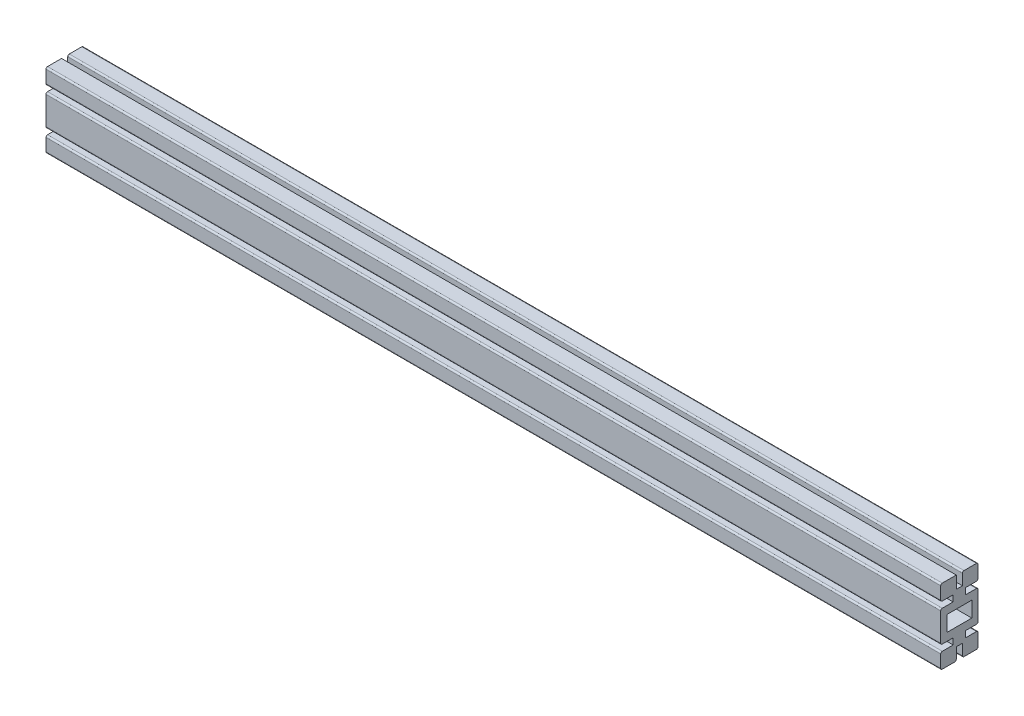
from build123d import *

# Parameters (mm, degrees)
SKETCH1_W           = 38.1
SKETCH1_H           = 76.2
BOSS_EXTRUDE1_DEPTH = 914.4
SKETCH2_W           = 12.7
SKETCH2_H           = 6.35
SKETCH2_W_2         = 6.35
SKETCH2_H_2         = 12.7
CUT_EXTRUDE1_DEPTH  = 916.391649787
SKETCH3_W           = 25.4
SKETCH3_H           = 15.875
CUT_EXTRUDE2_DEPTH  = 916.391649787
FILLET1_R           = 1.5748


with BuildPart() as part:
    # Sketch1 → Boss-Extrude1 (new body)
    with BuildSketch(Plane(origin=(0, 0, 0), x_dir=(0, 0, -1), z_dir=(1, 0, 0))):
        Rectangle(SKETCH1_W, SKETCH1_H)
    extrude(amount=-BOSS_EXTRUDE1_DEPTH)

    # Sketch2 → Cut-Extrude1 (cut, through all)
    with BuildSketch(Plane(origin=(0, 0, 0), x_dir=(0, 0, -1), z_dir=(1, 0, 0))):
        with Locations((-12.7, 19.05)):
            Rectangle(SKETCH2_W, SKETCH2_H)
        with Locations((-12.7, -19.05)):
            Rectangle(SKETCH2_W, SKETCH2_H)
        with Locations((12.7, -19.05)):
            Rectangle(SKETCH2_W, SKETCH2_H)
        with Locations((12.7, 19.05)):
            Rectangle(SKETCH2_W, SKETCH2_H)
        with Locations((0, 31.75)):
            Rectangle(SKETCH2_W_2, SKETCH2_H_2)
        with Locations((0, -31.75)):
            Rectangle(SKETCH2_W_2, SKETCH2_H_2)
    extrude(amount=-CUT_EXTRUDE1_DEPTH, mode=Mode.SUBTRACT)

    # Sketch3 → Cut-Extrude2 (cut, through all)
    with BuildSketch(Plane(origin=(0, 0, 0), x_dir=(0, 0, -1), z_dir=(1, 0, 0))):
        with Locations((0, 0.0127)):
            Rectangle(SKETCH3_W, SKETCH3_H)
    extrude(amount=-CUT_EXTRUDE2_DEPTH, mode=Mode.SUBTRACT)

    # Fillet1
    fillet1_edges = [part.edges().sort_by_distance(p)[0] for p in [
        (-457.2, 15.875, 19.05),
        (-457.2, 22.225, 19.05),
        (-457.2, -22.225, 19.05),
        (-457.2, -15.875, 19.05),
        (-457.2, -15.875, -19.05),
        (-457.2, -22.225, -19.05),
        (-457.2, 22.225, -19.05),
        (-457.2, 15.875, -19.05),
        (-457.2, 38.1, 19.05),
        (-457.2, 38.1, -3.175),
        (-457.2, 38.1, -19.05),
        (-457.2, -38.1, -19.05),
        (-457.2, -38.1, 19.05),
        (-457.2, -38.1, 3.175),
        (-457.2, -38.1, -3.175),
    ]]
    fillet(fillet1_edges, radius=FILLET1_R)


solid = part.part
